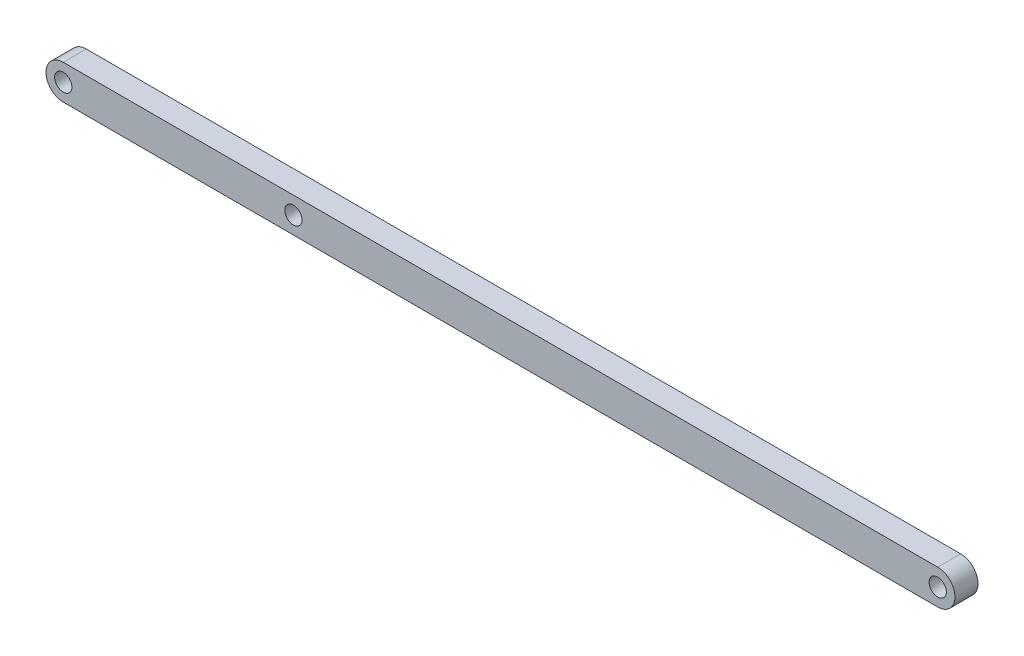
from build123d import *

# Parameters (mm, degrees)
ESQUISSE1_R             = 0.75
BASE_EXTRUSION_DEPTH    = 2
ESQUISSE2_R             = 0.75
ENL_V_MAT_EXTRU_1_DEPTH = 78.540312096


with BuildPart() as part:
    # Esquisse1 → Base-Extrusion (new body)
    with BuildSketch(Plane.XY):
        with BuildLine():
            Line((0, 1.5), (76, 1.5))
            ThreePointArc((76, 1.5), (77.5, 0), (76, -1.5))
            Line((76, -1.5), (0, -1.5))
            ThreePointArc((0, -1.5), (-1.5, 0), (0, 1.5))
        make_face()
        Circle(ESQUISSE1_R, mode=Mode.SUBTRACT)
        with Locations((76, 0)):
            Circle(ESQUISSE1_R, mode=Mode.SUBTRACT)
    extrude(amount=BASE_EXTRUSION_DEPTH)

    # Esquisse2 → Enl_v. mat.-Extru.1 (cut, through all)
    with BuildSketch(Plane.XY.offset(2)):
        with Locations((20, 0)):
            Circle(ESQUISSE2_R)
    extrude(amount=-ENL_V_MAT_EXTRU_1_DEPTH, mode=Mode.SUBTRACT)


solid = part.part
